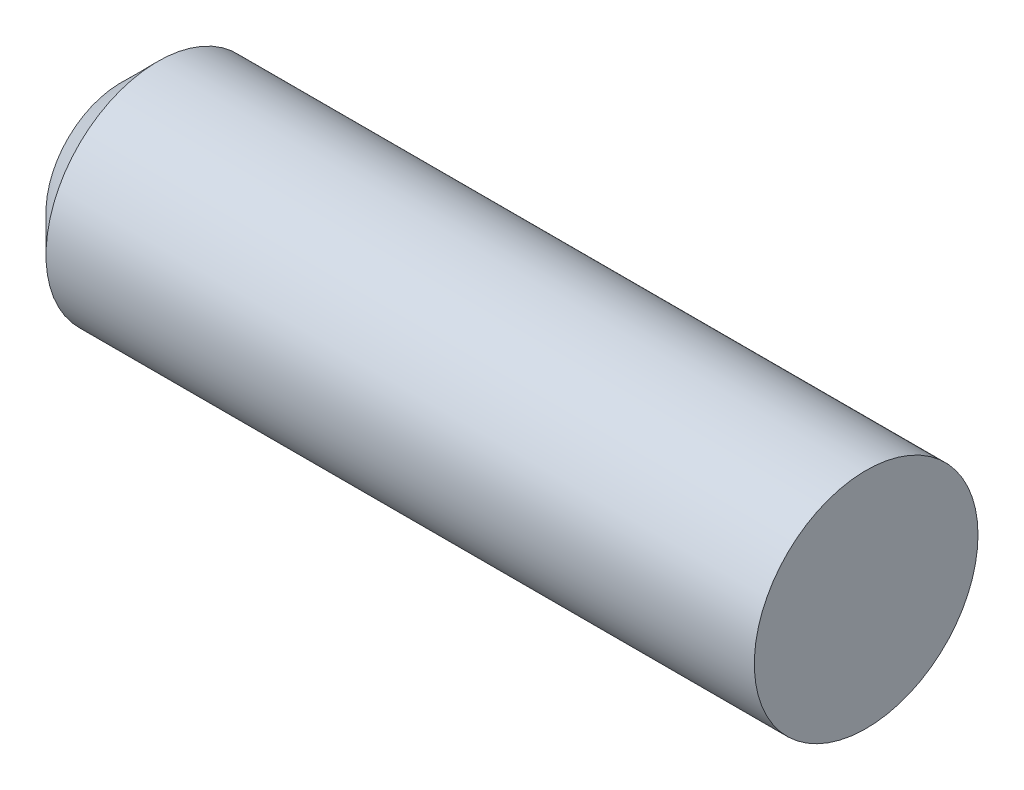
from build123d import *

# Parameters (mm, degrees)
SKETCH1_R           = 1.5
BOSS_EXTRUDE1_DEPTH = 10
CHAMFER1_SIZE       = 0.5


with BuildPart() as part:
    # Sketch1 → Boss-Extrude1 (new body)
    with BuildSketch(Plane.YZ):
        with Locations(Location((0, 0, 0), (0, 0, 270))):
            Circle(SKETCH1_R)
    extrude(amount=BOSS_EXTRUDE1_DEPTH)

    # Chamfer1
    chamfer1_edges = [part.edges().sort_by_distance(p)[0] for p in [
        (0, 0, 1.5),
    ]]
    chamfer(chamfer1_edges, length=CHAMFER1_SIZE)


solid = part.part
